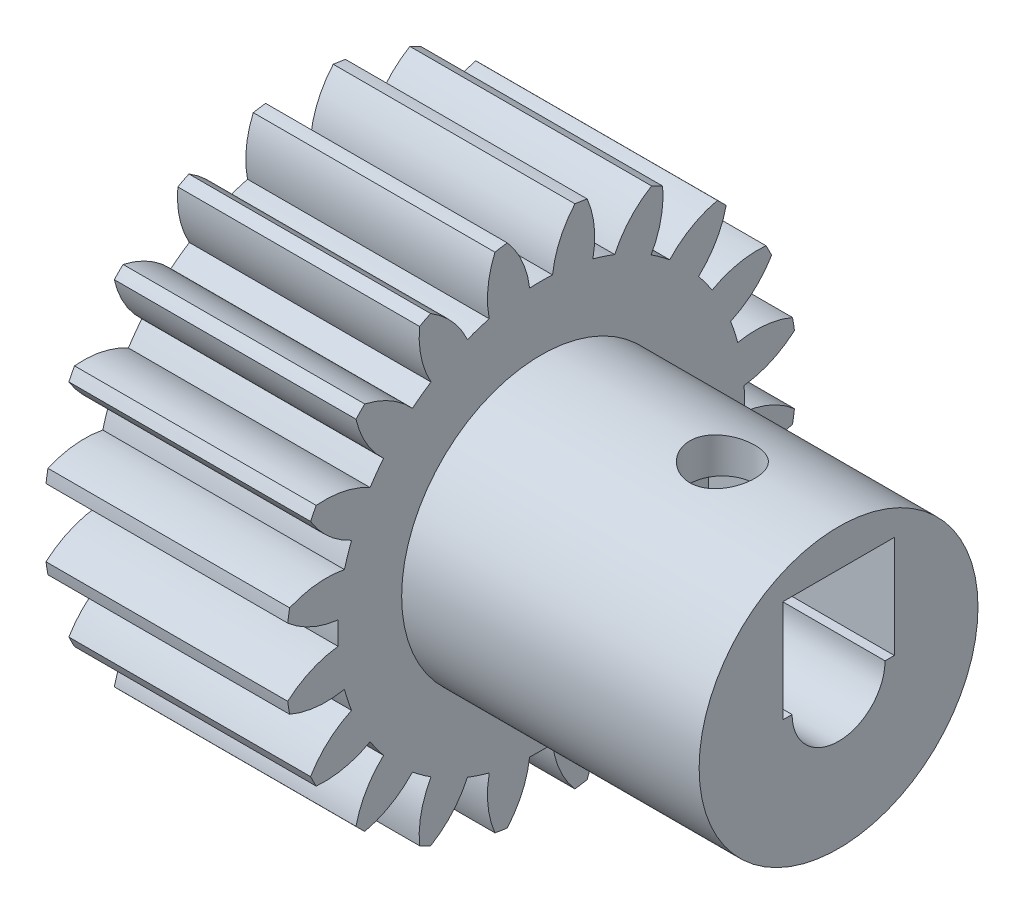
from build123d import *

# Parameters (mm, degrees)
BASPROSKE_W         = 52
BASPROSKE_H         = 55
TOOTHCUT_DEPTH      = 94.562813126
TEETHCUTS_COUNT     = 20
BORSKE_R            = 10.5
BORE_DEPTH          = 93.994517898
SCALE1_SCALE        = 0.25
SKETCH2_R           = 7.5
BOSS_EXTRUDE1_DEPTH = 16
SKETCH4_R           = 2.5
CUT_EXTRUDE2_DEPTH  = 35.820953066
SKETCH5_W           = 6
SKETCH5_H           = 5.5
CUT_EXTRUDE3_DEPTH  = 10
SKETCH6_R           = 1.75
CUT_EXTRUDE4_DEPTH  = 53.189546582


with BuildPart() as part:
    # BasProSke → Base-Revolve (revolve)
    with BuildSketch(Plane(origin=(0, 0, 0), x_dir=(1, 0, 0), z_dir=(0, 1, 0)), mode=Mode.PRIVATE) as base_revolve_sk:
        with Locations((26, 27.5)):
            Rectangle(BASPROSKE_W, BASPROSKE_H)
    revolve(base_revolve_sk.sketch.rotate(Axis((-10, 0, 0), (1, 0, 0)), 180), axis=Axis((-10, 0, 0), (1, 0, 0)))

    # TooCutSke → ToothCut (cut, through all)
    with BuildSketch(Plane(origin=(0, 0, 0), x_dir=(0, 0, -1), z_dir=(1, 0, 0))):
        with BuildLine():
            ThreePointArc((2.464838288, 43.679509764), (0, 43.749), (-2.464838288, 43.679509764))
            ThreePointArc((-2.464838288, 43.679509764), (-4.057398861, 49.476814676), (-7.300899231, 54.538899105))
            ThreePointArc((-7.300899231, 54.538899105), (0, 55.0254), (7.300899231, 54.538899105))
            ThreePointArc((7.300899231, 54.538899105), (4.057398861, 49.476814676), (2.464838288, 43.679509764))
        make_face()
    toothcut = extrude(amount=TOOTHCUT_DEPTH, mode=Mode.SUBTRACT)

    # TeethCuts: ToothCut ×20 about axis
    teethcuts_axis = Axis((0, 0, 0), (1, 0, 0))
    for i in range(1, TEETHCUTS_COUNT):
        add(toothcut.rotate(teethcuts_axis, i * 360 / TEETHCUTS_COUNT), mode=Mode.SUBTRACT)

    # BorSke → Bore (cut, through all)
    with BuildSketch(Plane(origin=(0, 0, 0), x_dir=(0, 0, -1), z_dir=(1, 0, 0))):
        with Locations(Location((0, 0, 0), (0, 0, 180))):
            Circle(BORSKE_R)
    extrude(amount=BORE_DEPTH, mode=Mode.SUBTRACT)


with BuildPart() as part_1:
    # Scale1: scaled about (26, 0, 0)
    add(part.part.scale(SCALE1_SCALE).moved(Location((19.5, 0, 0))))

    # Sketch2 → Boss-Extrude1 (add)
    with BuildSketch(Plane(origin=(32.5, 0, 0), x_dir=(0, 0, -1), z_dir=(1, 0, 0))):
        with Locations(Location((0, 0, 0), (0, 0, 180))):
            Circle(SKETCH2_R)
    extrude(amount=BOSS_EXTRUDE1_DEPTH)

    # Sketch4 → Cut-Extrude2 (cut, through all)
    with BuildSketch(Plane.ZY.offset(-19.5)):
        Circle(SKETCH4_R)
    extrude(amount=-CUT_EXTRUDE2_DEPTH, mode=Mode.SUBTRACT)

    # Sketch5 → Cut-Extrude3 (cut)
    with BuildSketch(Plane(origin=(48.5, 0, 0), x_dir=(0, 0, -1), z_dir=(1, 0, 0))):
        with Locations((0, 2.75)):
            Rectangle(SKETCH5_W, SKETCH5_H)
    extrude(amount=-CUT_EXTRUDE3_DEPTH, mode=Mode.SUBTRACT)

    # Sketch6 → Cut-Extrude4 (cut, through all)
    with BuildSketch(Plane(origin=(0, 0, 0), x_dir=(1, 0, 0), z_dir=(0, 1, 0))):
        with Locations(Location((42.25, 0, 0), (0, 0, 90))):
            Circle(SKETCH6_R)
    extrude(amount=CUT_EXTRUDE4_DEPTH, mode=Mode.SUBTRACT)


solid = part_1.part
